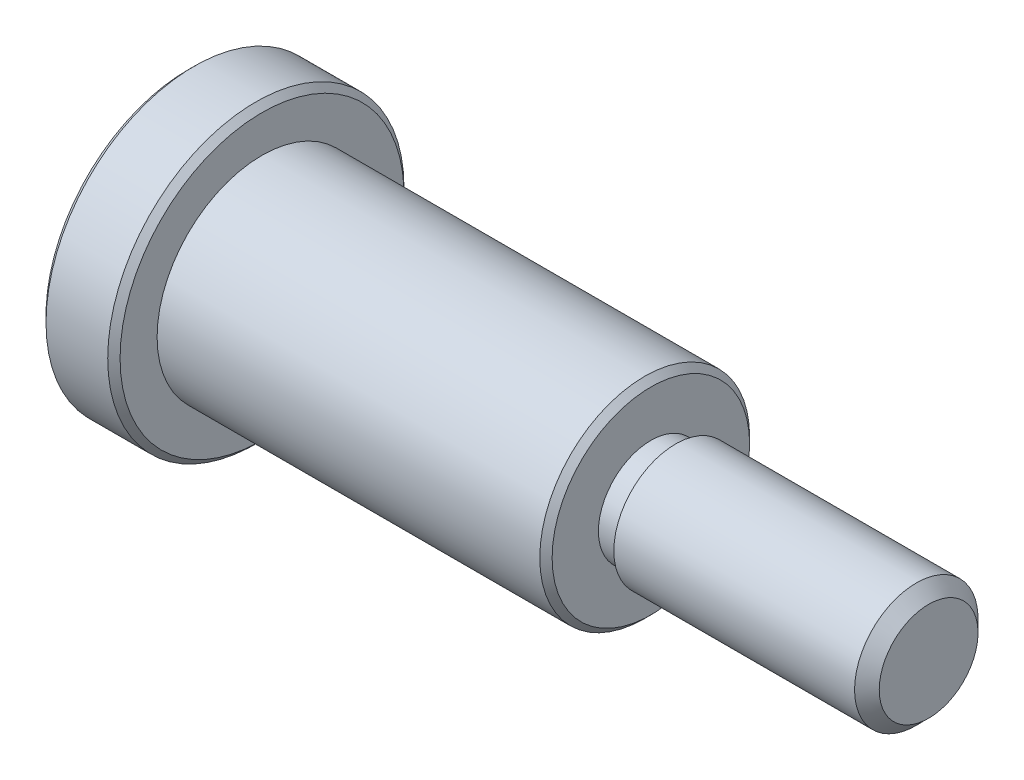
from build123d import *

# Parameters (mm, degrees)
DIAM_TRE_DU_PER_AGE_10_0_10_1_D     = 10
DIAM_TRE_DU_PER_AGE_10_0_10_1_DEPTH = 10
DIAM_TRE_DU_PER_AGE_10_0_10_1_TIP   = 3.004303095
CHANFREIN1_SIZE                     = 1
CHANFREIN2_SIZE                     = 0.5
ENL_V_MAT_EXTRU_1_DEPTH             = 10


with BuildPart() as part:
    # Esquisse1 → R_volution1 (revolve)
    with BuildSketch(Plane.XY, mode=Mode.PRIVATE) as r_volution1_sk:
        Polygon((37.5, 4.25), (39.5, 4.25), (39.5, 5), (60, 5), (60, 0), (0, 0), (0, 12), (6, 12), (6, 8.5), (37.5, 8.5), align=None)
    revolve(r_volution1_sk.sketch.rotate(Axis((-44.518364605, 0, 0), (1, 0, 0)), 90), axis=Axis((-44.518364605, 0, 0), (1, 0, 0)))

    # Diam_tre du per_age _10.0 _10_1
    with Locations(Plane.ZY):
        with Locations((0, 0)):
            Hole(DIAM_TRE_DU_PER_AGE_10_0_10_1_D / 2, depth=DIAM_TRE_DU_PER_AGE_10_0_10_1_DEPTH)
            with Locations((0, 0, -(DIAM_TRE_DU_PER_AGE_10_0_10_1_DEPTH + DIAM_TRE_DU_PER_AGE_10_0_10_1_TIP / 2))):  # 118° drill point
                Cone(0, DIAM_TRE_DU_PER_AGE_10_0_10_1_D / 2, DIAM_TRE_DU_PER_AGE_10_0_10_1_TIP, mode=Mode.SUBTRACT)

    # Chanfrein1
    chanfrein1_edges = [part.edges().sort_by_distance(p)[0] for p in [
        (0, 0, 5),
        (60, 0, -5),
    ]]
    chamfer(chanfrein1_edges, length=CHANFREIN1_SIZE)

    # Chanfrein2
    chanfrein2_edges = [part.edges().sort_by_distance(p)[0] for p in [
        (6, 0, -12),
        (0, 0, -12),
        (37.5, 0, -8.5),
    ]]
    chamfer(chanfrein2_edges, length=CHANFREIN2_SIZE)

    # Esquisse4 → Enl_v. mat.-Extru.1 (cut)
    with BuildSketch(Plane.ZY):
        Polygon((5.196152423, 3), (0, 6), (-5.196152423, 3), (-5.196152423, -3), (0, -6), (5.196152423, -3), align=None)
    extrude(amount=-ENL_V_MAT_EXTRU_1_DEPTH, mode=Mode.SUBTRACT)


solid = part.part
